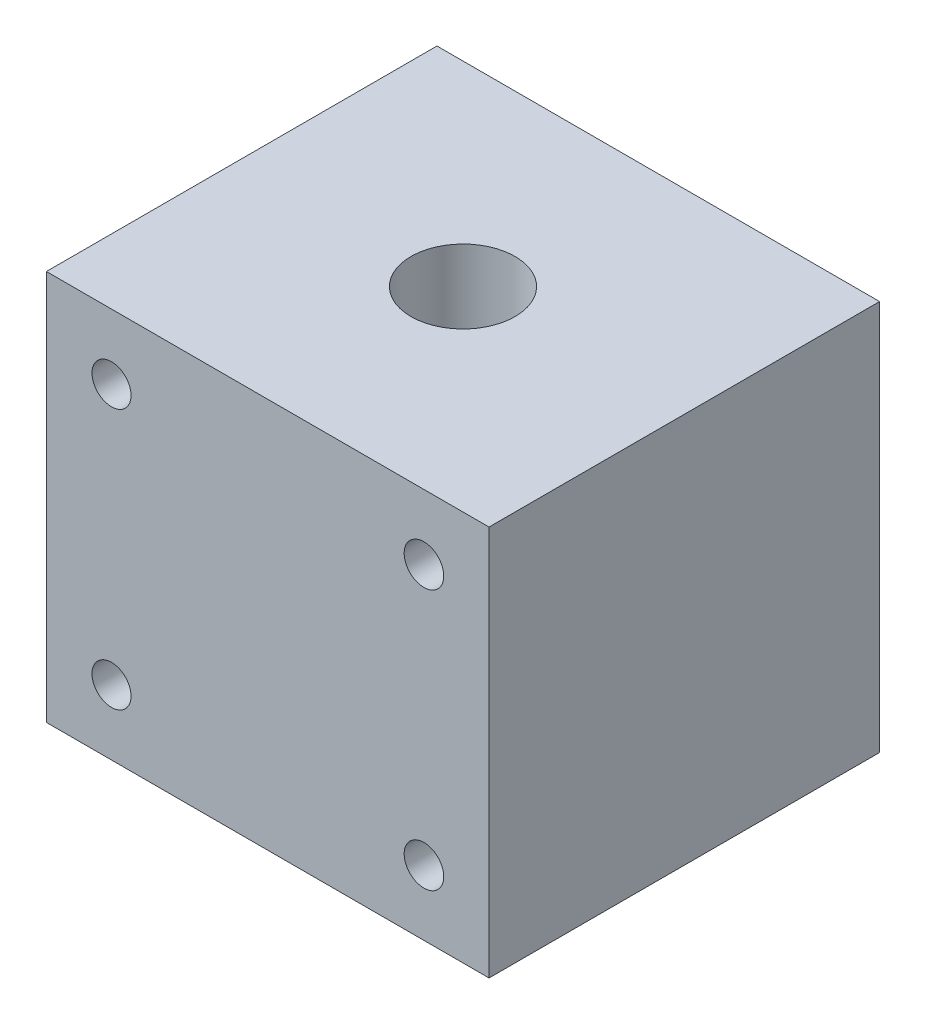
from build123d import *

# Parameters (mm, degrees)
CROQUIS1_W              = 34
CROQUIS1_H              = 30
CROQUIS1_R              = 4
SALIENTE_EXTRUIR1_DEPTH = 30
CROQUIS2_R              = 1.5
CROQUIS2_R_2            = 1.519884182
CORTAR_EXTRUIR1_DEPTH   = 10


with BuildPart() as part:
    # Croquis1 → Saliente-Extruir1 (new body)
    with BuildSketch(Plane(origin=(0, 0, 0), x_dir=(1, 0, 0), z_dir=(0, 1, 0))):
        with Locations((17, 15)):
            Rectangle(CROQUIS1_W, CROQUIS1_H)
        with Locations(Location((17, 15, 0), (0, 0, 270))):
            Circle(CROQUIS1_R, mode=Mode.SUBTRACT)
    extrude(amount=SALIENTE_EXTRUIR1_DEPTH)

    # Croquis2 → Cortar-Extruir1 (cut)
    with BuildSketch(Plane.XY):
        with Locations((5, 25)):
            Circle(CROQUIS2_R)
        with Locations((29, 25)):
            Circle(CROQUIS2_R_2)
        with Locations(Location((29, 5, 0), (0, 0, 180))):
            Circle(CROQUIS2_R_2)
        with Locations(Location((5, 5, 0), (0, 0, 180))):
            Circle(CROQUIS2_R)
    extrude(amount=-CORTAR_EXTRUIR1_DEPTH, mode=Mode.SUBTRACT)


solid = part.part
